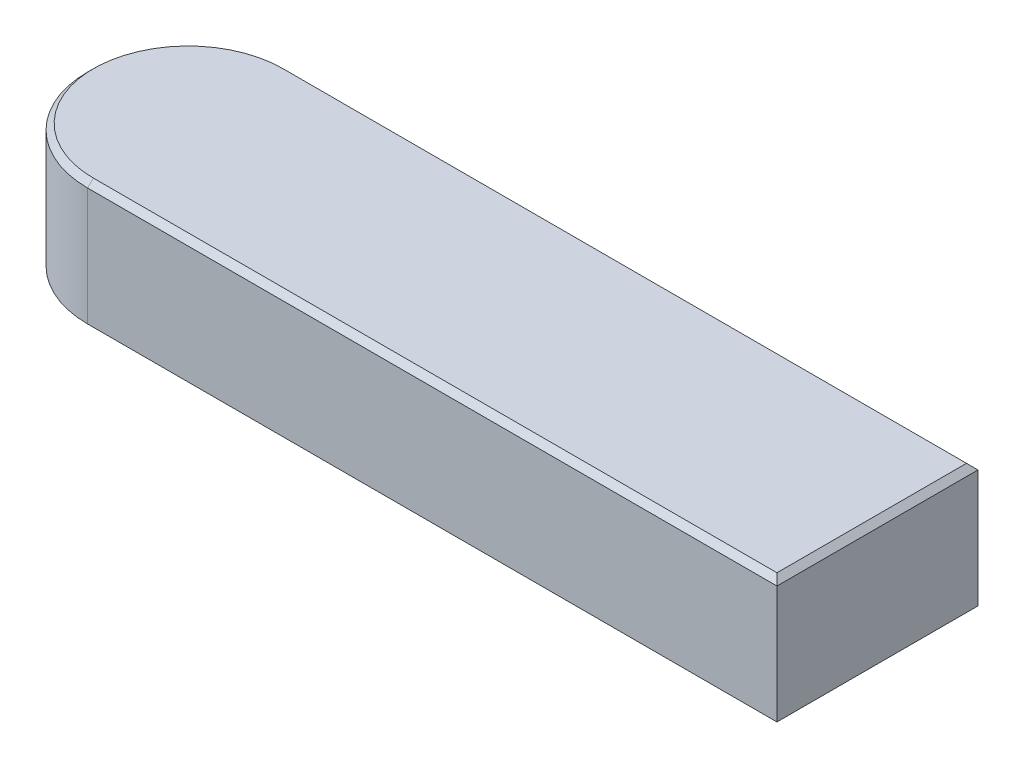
ISO-10303-21;
HEADER;
FILE_DESCRIPTION(('STEP AP214'),'2;1');
FILE_NAME('part.step','',(''),(''),'','','');
FILE_SCHEMA(('AUTOMOTIVE_DESIGN { 1 0 10303 214 1 1 1 1 }'));
ENDSEC;
DATA;
#1=APPLICATION_CONTEXT('core data for automotive mechanical design processes');
#2=APPLICATION_PROTOCOL_DEFINITION('international standard','automotive_design',2000,#1);
#3=PRODUCT_CONTEXT('',#1,'mechanical');
#4=PRODUCT('Part','Part','',(#3));
#5=PRODUCT_RELATED_PRODUCT_CATEGORY('part','',(#4));
#6=PRODUCT_DEFINITION_FORMATION('','',#4);
#7=PRODUCT_DEFINITION_CONTEXT('part definition',#1,'design');
#8=PRODUCT_DEFINITION('design','',#6,#7);
#9=PRODUCT_DEFINITION_SHAPE('','',#8);
#10=(LENGTH_UNIT() NAMED_UNIT(*) SI_UNIT(.MILLI.,.METRE.));
#11=(NAMED_UNIT(*) PLANE_ANGLE_UNIT() SI_UNIT($,.RADIAN.));
#12=(NAMED_UNIT(*) SI_UNIT($,.STERADIAN.) SOLID_ANGLE_UNIT());
#13=UNCERTAINTY_MEASURE_WITH_UNIT(LENGTH_MEASURE(1.E-05),#10,'distance_accuracy_value','');
#14=(GEOMETRIC_REPRESENTATION_CONTEXT(3) GLOBAL_UNCERTAINTY_ASSIGNED_CONTEXT((#13)) GLOBAL_UNIT_ASSIGNED_CONTEXT((#10,
#11,#12)) REPRESENTATION_CONTEXT('',''));
#15=CARTESIAN_POINT('',(0.,0.,0.));
#16=DIRECTION('',(0.,0.,1.));
#17=DIRECTION('',(1.,0.,0.));
#18=AXIS2_PLACEMENT_3D('',#15,#16,#17);
#19=CARTESIAN_POINT('',(0.,9.,0.));
#20=DIRECTION('',(0.,-1.,0.));
#21=DIRECTION('',(0.,0.,-1.));
#22=AXIS2_PLACEMENT_3D('',#19,#20,#21);
#23=CYLINDRICAL_SURFACE('',#22,7.);
#24=DIRECTION('',(0.,-1.,0.));
#25=VECTOR('',#24,1.);
#26=CARTESIAN_POINT('',(0.,9.,7.));
#27=LINE('',#26,#25);
#28=CARTESIAN_POINT('',(0.,8.59999999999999,7.));
#29=VERTEX_POINT('',#28);
#30=CARTESIAN_POINT('',(0.,0.400000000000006,7.));
#31=VERTEX_POINT('',#30);
#32=EDGE_CURVE('E114',#29,#31,#27,.T.);
#33=ORIENTED_EDGE('',*,*,#32,.F.);
#34=CARTESIAN_POINT('',(0.,8.59999999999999,0.));
#35=DIRECTION('',(0.,1.,0.));
#36=DIRECTION('',(0.,0.,1.));
#37=AXIS2_PLACEMENT_3D('',#34,#35,#36);
#38=CIRCLE('',#37,7.);
#39=CARTESIAN_POINT('',(0.,8.59999999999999,-7.));
#40=VERTEX_POINT('',#39);
#41=EDGE_CURVE('E138',#29,#40,#38,.F.);
#42=ORIENTED_EDGE('',*,*,#41,.T.);
#43=DIRECTION('',(0.,-1.,0.));
#44=VECTOR('',#43,1.);
#45=CARTESIAN_POINT('',(0.,9.,-7.));
#46=LINE('',#45,#44);
#47=CARTESIAN_POINT('',(0.,0.400000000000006,-7.));
#48=VERTEX_POINT('',#47);
#49=EDGE_CURVE('E165',#40,#48,#46,.T.);
#50=ORIENTED_EDGE('',*,*,#49,.T.);
#51=CARTESIAN_POINT('',(0.,0.400000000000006,0.));
#52=DIRECTION('',(0.,1.,0.));
#53=DIRECTION('',(0.,0.,1.));
#54=AXIS2_PLACEMENT_3D('',#51,#52,#53);
#55=CIRCLE('',#54,7.);
#56=EDGE_CURVE('E136',#48,#31,#55,.T.);
#57=ORIENTED_EDGE('',*,*,#56,.T.);
#58=EDGE_LOOP('',(#33,#42,#50,#57));
#59=FACE_BOUND('',#58,.T.);
#60=ADVANCED_FACE('F31',(#59),#23,.T.);
#61=CARTESIAN_POINT('',(48.,9.,6.99999999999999));
#62=DIRECTION('',(0.,0.,-1.));
#63=DIRECTION('',(-1.,0.,0.));
#64=AXIS2_PLACEMENT_3D('',#61,#62,#63);
#65=PLANE('',#64);
#66=DIRECTION('',(0.,-1.,0.));
#67=VECTOR('',#66,1.);
#68=CARTESIAN_POINT('',(48.,9.,6.99999999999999));
#69=LINE('',#68,#67);
#70=CARTESIAN_POINT('',(48.,8.6,6.99999999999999));
#71=VERTEX_POINT('',#70);
#72=CARTESIAN_POINT('',(48.,0.400000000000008,6.99999999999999));
#73=VERTEX_POINT('',#72);
#74=EDGE_CURVE('E171',#71,#73,#69,.T.);
#75=ORIENTED_EDGE('',*,*,#74,.F.);
#76=DIRECTION('',(-1.,0.,0.));
#77=VECTOR('',#76,1.);
#78=CARTESIAN_POINT('',(0.,8.6,7.));
#79=LINE('',#78,#77);
#80=EDGE_CURVE('E134',#71,#29,#79,.T.);
#81=ORIENTED_EDGE('',*,*,#80,.T.);
#82=ORIENTED_EDGE('',*,*,#32,.T.);
#83=DIRECTION('',(1.,0.,0.));
#84=VECTOR('',#83,1.);
#85=CARTESIAN_POINT('',(48.,0.400000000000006,6.99999999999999));
#86=LINE('',#85,#84);
#87=EDGE_CURVE('E131',#31,#73,#86,.T.);
#88=ORIENTED_EDGE('',*,*,#87,.T.);
#89=EDGE_LOOP('',(#75,#81,#82,#88));
#90=FACE_BOUND('',#89,.T.);
#91=ADVANCED_FACE('F196',(#90),#65,.F.);
#92=CARTESIAN_POINT('',(48.,9.,6.99999999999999));
#93=DIRECTION('',(-1.,0.,0.));
#94=DIRECTION('',(0.,0.,1.));
#95=AXIS2_PLACEMENT_3D('',#92,#93,#94);
#96=PLANE('',#95);
#97=DIRECTION('',(0.,-1.,0.));
#98=VECTOR('',#97,1.);
#99=CARTESIAN_POINT('',(48.,9.,-7.00000000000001));
#100=LINE('',#99,#98);
#101=CARTESIAN_POINT('',(48.,8.6,-7.00000000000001));
#102=VERTEX_POINT('',#101);
#103=CARTESIAN_POINT('',(48.,0.400000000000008,-7.00000000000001));
#104=VERTEX_POINT('',#103);
#105=EDGE_CURVE('E168',#102,#104,#100,.T.);
#106=ORIENTED_EDGE('',*,*,#105,.F.);
#107=DIRECTION('',(0.,0.,1.));
#108=VECTOR('',#107,1.);
#109=CARTESIAN_POINT('',(48.,8.6,6.99999999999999));
#110=LINE('',#109,#108);
#111=EDGE_CURVE('E129',#102,#71,#110,.T.);
#112=ORIENTED_EDGE('',*,*,#111,.T.);
#113=ORIENTED_EDGE('',*,*,#74,.T.);
#114=DIRECTION('',(0.,0.,-1.));
#115=VECTOR('',#114,1.);
#116=CARTESIAN_POINT('',(48.,0.400000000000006,6.99999999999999));
#117=LINE('',#116,#115);
#118=EDGE_CURVE('E127',#73,#104,#117,.T.);
#119=ORIENTED_EDGE('',*,*,#118,.T.);
#120=EDGE_LOOP('',(#106,#112,#113,#119));
#121=FACE_BOUND('',#120,.T.);
#122=ADVANCED_FACE('F188',(#121),#96,.F.);
#123=CARTESIAN_POINT('',(48.,9.,-7.00000000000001));
#124=DIRECTION('',(0.,0.,1.));
#125=DIRECTION('',(1.,0.,0.));
#126=AXIS2_PLACEMENT_3D('',#123,#124,#125);
#127=PLANE('',#126);
#128=ORIENTED_EDGE('',*,*,#49,.F.);
#129=DIRECTION('',(1.,0.,0.));
#130=VECTOR('',#129,1.);
#131=CARTESIAN_POINT('',(48.,8.6,-7.00000000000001));
#132=LINE('',#131,#130);
#133=EDGE_CURVE('E100',#40,#102,#132,.T.);
#134=ORIENTED_EDGE('',*,*,#133,.T.);
#135=ORIENTED_EDGE('',*,*,#105,.T.);
#136=DIRECTION('',(-1.,0.,0.));
#137=VECTOR('',#136,1.);
#138=CARTESIAN_POINT('',(48.,0.400000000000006,-7.00000000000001));
#139=LINE('',#138,#137);
#140=EDGE_CURVE('E120',#104,#48,#139,.T.);
#141=ORIENTED_EDGE('',*,*,#140,.T.);
#142=EDGE_LOOP('',(#128,#134,#135,#141));
#143=FACE_BOUND('',#142,.T.);
#144=ADVANCED_FACE('F187',(#143),#127,.F.);
#145=CARTESIAN_POINT('',(0.,9.,0.));
#146=DIRECTION('',(0.,1.,0.));
#147=DIRECTION('',(0.,0.,1.));
#148=AXIS2_PLACEMENT_3D('',#145,#146,#147);
#149=PLANE('',#148);
#150=DIRECTION('',(0.,0.,-1.));
#151=VECTOR('',#150,1.);
#152=CARTESIAN_POINT('',(47.6,9.,-7.00000000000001));
#153=LINE('',#152,#151);
#154=CARTESIAN_POINT('',(47.6,9.,6.59999999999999));
#155=VERTEX_POINT('',#154);
#156=CARTESIAN_POINT('',(47.6,9.,-6.6));
#157=VERTEX_POINT('',#156);
#158=EDGE_CURVE('E118',#155,#157,#153,.T.);
#159=ORIENTED_EDGE('',*,*,#158,.T.);
#160=DIRECTION('',(-1.,0.,0.));
#161=VECTOR('',#160,1.);
#162=CARTESIAN_POINT('',(0.,9.,-6.59999999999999));
#163=LINE('',#162,#161);
#164=CARTESIAN_POINT('',(0.,9.,-6.6));
#165=VERTEX_POINT('',#164);
#166=EDGE_CURVE('E98',#157,#165,#163,.T.);
#167=ORIENTED_EDGE('',*,*,#166,.T.);
#168=CARTESIAN_POINT('',(0.,9.,0.));
#169=DIRECTION('',(0.,1.,0.));
#170=DIRECTION('',(0.,0.,1.));
#171=AXIS2_PLACEMENT_3D('',#168,#169,#170);
#172=CIRCLE('',#171,6.6);
#173=CARTESIAN_POINT('',(0.,9.,6.6));
#174=VERTEX_POINT('',#173);
#175=EDGE_CURVE('E107',#165,#174,#172,.T.);
#176=ORIENTED_EDGE('',*,*,#175,.T.);
#177=DIRECTION('',(1.,0.,0.));
#178=VECTOR('',#177,1.);
#179=CARTESIAN_POINT('',(48.,9.,6.59999999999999));
#180=LINE('',#179,#178);
#181=EDGE_CURVE('E113',#174,#155,#180,.T.);
#182=ORIENTED_EDGE('',*,*,#181,.T.);
#183=EDGE_LOOP('',(#159,#167,#176,#182));
#184=FACE_BOUND('',#183,.T.);
#185=ADVANCED_FACE('F116',(#184),#149,.T.);
#186=CARTESIAN_POINT('',(0.,0.,0.));
#187=DIRECTION('',(0.,1.,0.));
#188=DIRECTION('',(0.,0.,1.));
#189=AXIS2_PLACEMENT_3D('',#186,#187,#188);
#190=PLANE('',#189);
#191=DIRECTION('',(0.,0.,1.));
#192=VECTOR('',#191,1.);
#193=CARTESIAN_POINT('',(47.6,0.,0.));
#194=LINE('',#193,#192);
#195=CARTESIAN_POINT('',(47.6,0.,-6.6));
#196=VERTEX_POINT('',#195);
#197=CARTESIAN_POINT('',(47.6,0.,6.59999999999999));
#198=VERTEX_POINT('',#197);
#199=EDGE_CURVE('E38',#196,#198,#194,.T.);
#200=ORIENTED_EDGE('',*,*,#199,.T.);
#201=DIRECTION('',(-1.,0.,0.));
#202=VECTOR('',#201,1.);
#203=CARTESIAN_POINT('',(0.,0.,6.6));
#204=LINE('',#203,#202);
#205=CARTESIAN_POINT('',(0.,0.,6.6));
#206=VERTEX_POINT('',#205);
#207=EDGE_CURVE('E11',#198,#206,#204,.T.);
#208=ORIENTED_EDGE('',*,*,#207,.T.);
#209=CARTESIAN_POINT('',(0.,0.,0.));
#210=DIRECTION('',(0.,1.,0.));
#211=DIRECTION('',(0.,0.,1.));
#212=AXIS2_PLACEMENT_3D('',#209,#210,#211);
#213=CIRCLE('',#212,6.6);
#214=CARTESIAN_POINT('',(0.,0.,-6.6));
#215=VERTEX_POINT('',#214);
#216=EDGE_CURVE('E140',#206,#215,#213,.F.);
#217=ORIENTED_EDGE('',*,*,#216,.T.);
#218=DIRECTION('',(1.,0.,0.));
#219=VECTOR('',#218,1.);
#220=CARTESIAN_POINT('',(0.,0.,-6.6));
#221=LINE('',#220,#219);
#222=EDGE_CURVE('E48',#215,#196,#221,.T.);
#223=ORIENTED_EDGE('',*,*,#222,.T.);
#224=EDGE_LOOP('',(#200,#208,#217,#223));
#225=FACE_BOUND('',#224,.T.);
#226=ADVANCED_FACE('F143',(#225),#190,.F.);
#227=CARTESIAN_POINT('',(0.,9.,6.59999999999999));
#228=DIRECTION('',(0.,0.707106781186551,0.707106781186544));
#229=DIRECTION('',(0.,-0.707106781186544,0.707106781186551));
#230=AXIS2_PLACEMENT_3D('',#227,#228,#229);
#231=PLANE('',#230);
#232=DIRECTION('',(0.,0.707106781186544,-0.707106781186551));
#233=VECTOR('',#232,1.);
#234=CARTESIAN_POINT('',(0.,8.6,7.));
#235=LINE('',#234,#233);
#236=EDGE_CURVE('E110',#29,#174,#235,.T.);
#237=ORIENTED_EDGE('',*,*,#236,.F.);
#238=ORIENTED_EDGE('',*,*,#80,.F.);
#239=DIRECTION('',(-0.577350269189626,0.577350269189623,-0.577350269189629));
#240=VECTOR('',#239,1.);
#241=CARTESIAN_POINT('',(31.7333333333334,24.8666666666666,-9.26666666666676));
#242=LINE('',#241,#240);
#243=EDGE_CURVE('E162',#155,#71,#242,.F.);
#244=ORIENTED_EDGE('',*,*,#243,.F.);
#245=ORIENTED_EDGE('',*,*,#181,.F.);
#246=EDGE_LOOP('',(#237,#238,#244,#245));
#247=FACE_BOUND('',#246,.T.);
#248=ADVANCED_FACE('F178',(#247),#231,.T.);
#249=CARTESIAN_POINT('',(47.6,9.,0.));
#250=DIRECTION('',(0.707106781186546,0.707106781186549,0.));
#251=DIRECTION('',(-0.707106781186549,0.707106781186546,0.));
#252=AXIS2_PLACEMENT_3D('',#249,#250,#251);
#253=PLANE('',#252);
#254=ORIENTED_EDGE('',*,*,#243,.T.);
#255=ORIENTED_EDGE('',*,*,#111,.F.);
#256=DIRECTION('',(-0.577350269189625,0.577350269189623,0.577350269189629));
#257=VECTOR('',#256,1.);
#258=CARTESIAN_POINT('',(45.4,11.2,-4.39999999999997));
#259=LINE('',#258,#257);
#260=EDGE_CURVE('E103',#157,#102,#259,.F.);
#261=ORIENTED_EDGE('',*,*,#260,.F.);
#262=ORIENTED_EDGE('',*,*,#158,.F.);
#263=EDGE_LOOP('',(#254,#255,#261,#262));
#264=FACE_BOUND('',#263,.T.);
#265=ADVANCED_FACE('F181',(#264),#253,.T.);
#266=CARTESIAN_POINT('',(0.,9.,0.));
#267=DIRECTION('',(0.,-1.,0.));
#268=DIRECTION('',(0.,0.,-1.));
#269=AXIS2_PLACEMENT_3D('',#266,#267,#268);
#270=CONICAL_SURFACE('',#269,6.6,0.785398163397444);
#271=ORIENTED_EDGE('',*,*,#236,.T.);
#272=ORIENTED_EDGE('',*,*,#175,.F.);
#273=DIRECTION('',(0.,0.707106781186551,0.707106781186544));
#274=VECTOR('',#273,1.);
#275=CARTESIAN_POINT('',(0.,8.59999999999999,-7.));
#276=LINE('',#275,#274);
#277=EDGE_CURVE('E94',#40,#165,#276,.T.);
#278=ORIENTED_EDGE('',*,*,#277,.F.);
#279=ORIENTED_EDGE('',*,*,#41,.F.);
#280=EDGE_LOOP('',(#271,#272,#278,#279));
#281=FACE_BOUND('',#280,.T.);
#282=ADVANCED_FACE('F108',(#281),#270,.T.);
#283=CARTESIAN_POINT('',(0.,9.,-6.59999999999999));
#284=DIRECTION('',(0.,0.707106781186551,-0.707106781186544));
#285=DIRECTION('',(0.,0.707106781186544,0.707106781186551));
#286=AXIS2_PLACEMENT_3D('',#283,#284,#285);
#287=PLANE('',#286);
#288=ORIENTED_EDGE('',*,*,#260,.T.);
#289=ORIENTED_EDGE('',*,*,#133,.F.);
#290=ORIENTED_EDGE('',*,*,#277,.T.);
#291=ORIENTED_EDGE('',*,*,#166,.F.);
#292=EDGE_LOOP('',(#288,#289,#290,#291));
#293=FACE_BOUND('',#292,.T.);
#294=ADVANCED_FACE('F96',(#293),#287,.T.);
#295=CARTESIAN_POINT('',(48.,0.400000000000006,-7.00000000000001));
#296=DIRECTION('',(0.,0.707106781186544,0.707106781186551));
#297=DIRECTION('',(0.,-0.707106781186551,0.707106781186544));
#298=AXIS2_PLACEMENT_3D('',#295,#296,#297);
#299=PLANE('',#298);
#300=DIRECTION('',(-0.577350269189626,-0.577350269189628,0.577350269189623));
#301=VECTOR('',#300,1.);
#302=CARTESIAN_POINT('',(48.,0.400000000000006,-7.00000000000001));
#303=LINE('',#302,#301);
#304=EDGE_CURVE('E153',#196,#104,#303,.F.);
#305=ORIENTED_EDGE('',*,*,#304,.F.);
#306=ORIENTED_EDGE('',*,*,#222,.F.);
#307=DIRECTION('',(0.,-0.707106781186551,0.707106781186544));
#308=VECTOR('',#307,1.);
#309=CARTESIAN_POINT('',(0.,0.400000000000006,-7.));
#310=LINE('',#309,#308);
#311=EDGE_CURVE('E104',#48,#215,#310,.T.);
#312=ORIENTED_EDGE('',*,*,#311,.F.);
#313=ORIENTED_EDGE('',*,*,#140,.F.);
#314=EDGE_LOOP('',(#305,#306,#312,#313));
#315=FACE_BOUND('',#314,.T.);
#316=ADVANCED_FACE('F149',(#315),#299,.F.);
#317=CARTESIAN_POINT('',(0.,0.400000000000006,0.));
#318=DIRECTION('',(0.,1.,0.));
#319=DIRECTION('',(0.,0.,1.));
#320=AXIS2_PLACEMENT_3D('',#317,#318,#319);
#321=CONICAL_SURFACE('',#320,7.,0.785398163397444);
#322=ORIENTED_EDGE('',*,*,#311,.T.);
#323=ORIENTED_EDGE('',*,*,#216,.F.);
#324=DIRECTION('',(0.,-0.707106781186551,-0.707106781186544));
#325=VECTOR('',#324,1.);
#326=CARTESIAN_POINT('',(0.,0.400000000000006,7.));
#327=LINE('',#326,#325);
#328=EDGE_CURVE('E156',#31,#206,#327,.T.);
#329=ORIENTED_EDGE('',*,*,#328,.F.);
#330=ORIENTED_EDGE('',*,*,#56,.F.);
#331=EDGE_LOOP('',(#322,#323,#329,#330));
#332=FACE_BOUND('',#331,.T.);
#333=ADVANCED_FACE('F154',(#332),#321,.T.);
#334=CARTESIAN_POINT('',(48.,0.400000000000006,6.99999999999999));
#335=DIRECTION('',(-0.707106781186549,0.707106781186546,0.));
#336=DIRECTION('',(-0.707106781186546,-0.707106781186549,0.));
#337=AXIS2_PLACEMENT_3D('',#334,#335,#336);
#338=PLANE('',#337);
#339=ORIENTED_EDGE('',*,*,#304,.T.);
#340=ORIENTED_EDGE('',*,*,#118,.F.);
#341=DIRECTION('',(-0.577350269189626,-0.577350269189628,-0.577350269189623));
#342=VECTOR('',#341,1.);
#343=CARTESIAN_POINT('',(48.,0.400000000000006,6.99999999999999));
#344=LINE('',#343,#342);
#345=EDGE_CURVE('E193',#198,#73,#344,.F.);
#346=ORIENTED_EDGE('',*,*,#345,.F.);
#347=ORIENTED_EDGE('',*,*,#199,.F.);
#348=EDGE_LOOP('',(#339,#340,#346,#347));
#349=FACE_BOUND('',#348,.T.);
#350=ADVANCED_FACE('F192',(#349),#338,.F.);
#351=CARTESIAN_POINT('',(48.,0.400000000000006,6.99999999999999));
#352=DIRECTION('',(0.,0.707106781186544,-0.707106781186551));
#353=DIRECTION('',(0.,0.707106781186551,0.707106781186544));
#354=AXIS2_PLACEMENT_3D('',#351,#352,#353);
#355=PLANE('',#354);
#356=ORIENTED_EDGE('',*,*,#328,.T.);
#357=ORIENTED_EDGE('',*,*,#207,.F.);
#358=ORIENTED_EDGE('',*,*,#345,.T.);
#359=ORIENTED_EDGE('',*,*,#87,.F.);
#360=EDGE_LOOP('',(#356,#357,#358,#359));
#361=FACE_BOUND('',#360,.T.);
#362=ADVANCED_FACE('F199',(#361),#355,.F.);
#363=CLOSED_SHELL('',(#60,#91,#122,#144,#185,#226,#248,#265,#282,#294,#316,#333,#350,#362));
#364=MANIFOLD_SOLID_BREP('B2',#363);
#365=ADVANCED_BREP_SHAPE_REPRESENTATION('',(#18,#364),#14);
#366=SHAPE_DEFINITION_REPRESENTATION(#9,#365);
ENDSEC;
END-ISO-10303-21;
